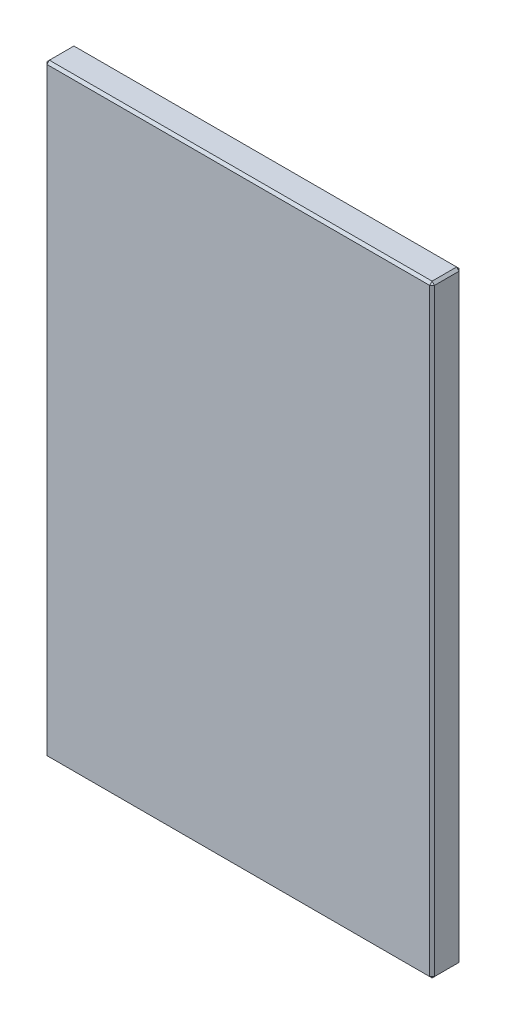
ISO-10303-21;
HEADER;
FILE_DESCRIPTION(('STEP AP214'),'2;1');
FILE_NAME('part.step','',(''),(''),'','','');
FILE_SCHEMA(('AUTOMOTIVE_DESIGN { 1 0 10303 214 1 1 1 1 }'));
ENDSEC;
DATA;
#1=APPLICATION_CONTEXT('core data for automotive mechanical design processes');
#2=APPLICATION_PROTOCOL_DEFINITION('international standard','automotive_design',2000,#1);
#3=PRODUCT_CONTEXT('',#1,'mechanical');
#4=PRODUCT('Part','Part','',(#3));
#5=PRODUCT_RELATED_PRODUCT_CATEGORY('part','',(#4));
#6=PRODUCT_DEFINITION_FORMATION('','',#4);
#7=PRODUCT_DEFINITION_CONTEXT('part definition',#1,'design');
#8=PRODUCT_DEFINITION('design','',#6,#7);
#9=PRODUCT_DEFINITION_SHAPE('','',#8);
#10=(LENGTH_UNIT() NAMED_UNIT(*) SI_UNIT(.MILLI.,.METRE.));
#11=(NAMED_UNIT(*) PLANE_ANGLE_UNIT() SI_UNIT($,.RADIAN.));
#12=(NAMED_UNIT(*) SI_UNIT($,.STERADIAN.) SOLID_ANGLE_UNIT());
#13=UNCERTAINTY_MEASURE_WITH_UNIT(LENGTH_MEASURE(1.E-05),#10,'distance_accuracy_value','');
#14=(GEOMETRIC_REPRESENTATION_CONTEXT(3) GLOBAL_UNCERTAINTY_ASSIGNED_CONTEXT((#13)) GLOBAL_UNIT_ASSIGNED_CONTEXT((#10,
#11,#12)) REPRESENTATION_CONTEXT('',''));
#15=CARTESIAN_POINT('',(0.,0.,0.));
#16=DIRECTION('',(0.,0.,1.));
#17=DIRECTION('',(1.,0.,0.));
#18=AXIS2_PLACEMENT_3D('',#15,#16,#17);
#19=CARTESIAN_POINT('',(-79.,-123.,12.));
#20=DIRECTION('',(1.,0.,0.));
#21=DIRECTION('',(0.,0.,-1.));
#22=AXIS2_PLACEMENT_3D('',#19,#20,#21);
#23=PLANE('',#22);
#24=DIRECTION('',(0.,0.,-1.));
#25=VECTOR('',#24,1.);
#26=CARTESIAN_POINT('',(-79.,122.,12.));
#27=LINE('',#26,#25);
#28=CARTESIAN_POINT('',(-79.,122.,11.));
#29=VERTEX_POINT('',#28);
#30=CARTESIAN_POINT('',(-79.,122.,1.));
#31=VERTEX_POINT('',#30);
#32=EDGE_CURVE('E114',#29,#31,#27,.T.);
#33=ORIENTED_EDGE('',*,*,#32,.T.);
#34=DIRECTION('',(0.,-1.,0.));
#35=VECTOR('',#34,1.);
#36=CARTESIAN_POINT('',(-79.,-123.,1.));
#37=LINE('',#36,#35);
#38=CARTESIAN_POINT('',(-79.,-122.,1.));
#39=VERTEX_POINT('',#38);
#40=EDGE_CURVE('E110',#31,#39,#37,.T.);
#41=ORIENTED_EDGE('',*,*,#40,.T.);
#42=DIRECTION('',(0.,0.,1.));
#43=VECTOR('',#42,1.);
#44=CARTESIAN_POINT('',(-79.,-122.,12.));
#45=LINE('',#44,#43);
#46=CARTESIAN_POINT('',(-79.,-122.,11.));
#47=VERTEX_POINT('',#46);
#48=EDGE_CURVE('E103',#39,#47,#45,.T.);
#49=ORIENTED_EDGE('',*,*,#48,.T.);
#50=DIRECTION('',(0.,1.,0.));
#51=VECTOR('',#50,1.);
#52=CARTESIAN_POINT('',(-79.,123.,11.));
#53=LINE('',#52,#51);
#54=EDGE_CURVE('E107',#47,#29,#53,.T.);
#55=ORIENTED_EDGE('',*,*,#54,.T.);
#56=EDGE_LOOP('',(#33,#41,#49,#55));
#57=FACE_BOUND('',#56,.T.);
#58=ADVANCED_FACE('F15',(#57),#23,.F.);
#59=CARTESIAN_POINT('',(79.,-123.,12.));
#60=DIRECTION('',(0.,1.,0.));
#61=DIRECTION('',(0.,0.,1.));
#62=AXIS2_PLACEMENT_3D('',#59,#60,#61);
#63=PLANE('',#62);
#64=DIRECTION('',(0.,0.,-1.));
#65=VECTOR('',#64,1.);
#66=CARTESIAN_POINT('',(-78.,-123.,12.));
#67=LINE('',#66,#65);
#68=CARTESIAN_POINT('',(-78.,-123.,11.));
#69=VERTEX_POINT('',#68);
#70=CARTESIAN_POINT('',(-78.,-123.,1.));
#71=VERTEX_POINT('',#70);
#72=EDGE_CURVE('E122',#69,#71,#67,.T.);
#73=ORIENTED_EDGE('',*,*,#72,.T.);
#74=DIRECTION('',(1.,0.,0.));
#75=VECTOR('',#74,1.);
#76=CARTESIAN_POINT('',(79.,-123.,1.));
#77=LINE('',#76,#75);
#78=CARTESIAN_POINT('',(78.,-123.,1.));
#79=VERTEX_POINT('',#78);
#80=EDGE_CURVE('E160',#71,#79,#77,.T.);
#81=ORIENTED_EDGE('',*,*,#80,.T.);
#82=DIRECTION('',(0.,0.,1.));
#83=VECTOR('',#82,1.);
#84=CARTESIAN_POINT('',(78.,-123.,12.));
#85=LINE('',#84,#83);
#86=CARTESIAN_POINT('',(78.,-123.,11.));
#87=VERTEX_POINT('',#86);
#88=EDGE_CURVE('E157',#79,#87,#85,.T.);
#89=ORIENTED_EDGE('',*,*,#88,.T.);
#90=DIRECTION('',(-1.,0.,0.));
#91=VECTOR('',#90,1.);
#92=CARTESIAN_POINT('',(-79.,-123.,11.));
#93=LINE('',#92,#91);
#94=EDGE_CURVE('E155',#87,#69,#93,.T.);
#95=ORIENTED_EDGE('',*,*,#94,.T.);
#96=EDGE_LOOP('',(#73,#81,#89,#95));
#97=FACE_BOUND('',#96,.T.);
#98=ADVANCED_FACE('F277',(#97),#63,.F.);
#99=CARTESIAN_POINT('',(79.,-123.,12.));
#100=DIRECTION('',(-1.,0.,0.));
#101=DIRECTION('',(0.,0.,1.));
#102=AXIS2_PLACEMENT_3D('',#99,#100,#101);
#103=PLANE('',#102);
#104=DIRECTION('',(0.,-1.,0.));
#105=VECTOR('',#104,1.);
#106=CARTESIAN_POINT('',(79.,-123.,11.));
#107=LINE('',#106,#105);
#108=CARTESIAN_POINT('',(79.,122.,11.));
#109=VERTEX_POINT('',#108);
#110=CARTESIAN_POINT('',(79.,-122.,11.));
#111=VERTEX_POINT('',#110);
#112=EDGE_CURVE('E162',#109,#111,#107,.T.);
#113=ORIENTED_EDGE('',*,*,#112,.T.);
#114=DIRECTION('',(0.,0.,-1.));
#115=VECTOR('',#114,1.);
#116=CARTESIAN_POINT('',(79.,-122.,12.));
#117=LINE('',#116,#115);
#118=CARTESIAN_POINT('',(79.,-122.,1.));
#119=VERTEX_POINT('',#118);
#120=EDGE_CURVE('E168',#111,#119,#117,.T.);
#121=ORIENTED_EDGE('',*,*,#120,.T.);
#122=DIRECTION('',(0.,1.,0.));
#123=VECTOR('',#122,1.);
#124=CARTESIAN_POINT('',(79.,-123.,1.));
#125=LINE('',#124,#123);
#126=CARTESIAN_POINT('',(79.,122.,1.));
#127=VERTEX_POINT('',#126);
#128=EDGE_CURVE('E166',#119,#127,#125,.T.);
#129=ORIENTED_EDGE('',*,*,#128,.T.);
#130=DIRECTION('',(0.,0.,1.));
#131=VECTOR('',#130,1.);
#132=CARTESIAN_POINT('',(79.,122.,12.));
#133=LINE('',#132,#131);
#134=EDGE_CURVE('E164',#127,#109,#133,.T.);
#135=ORIENTED_EDGE('',*,*,#134,.T.);
#136=EDGE_LOOP('',(#113,#121,#129,#135));
#137=FACE_BOUND('',#136,.T.);
#138=ADVANCED_FACE('F254',(#137),#103,.F.);
#139=CARTESIAN_POINT('',(79.,123.,12.));
#140=DIRECTION('',(0.,-1.,0.));
#141=DIRECTION('',(1.,0.,0.));
#142=AXIS2_PLACEMENT_3D('',#139,#140,#141);
#143=PLANE('',#142);
#144=DIRECTION('',(-1.,0.,0.));
#145=VECTOR('',#144,1.);
#146=CARTESIAN_POINT('',(79.,123.,1.));
#147=LINE('',#146,#145);
#148=CARTESIAN_POINT('',(78.,123.,1.));
#149=VERTEX_POINT('',#148);
#150=CARTESIAN_POINT('',(-78.,123.,1.));
#151=VERTEX_POINT('',#150);
#152=EDGE_CURVE('E150',#149,#151,#147,.T.);
#153=ORIENTED_EDGE('',*,*,#152,.T.);
#154=DIRECTION('',(0.,0.,1.));
#155=VECTOR('',#154,1.);
#156=CARTESIAN_POINT('',(-78.,123.,12.));
#157=LINE('',#156,#155);
#158=CARTESIAN_POINT('',(-78.,123.,11.));
#159=VERTEX_POINT('',#158);
#160=EDGE_CURVE('E152',#151,#159,#157,.T.);
#161=ORIENTED_EDGE('',*,*,#160,.T.);
#162=DIRECTION('',(1.,0.,0.));
#163=VECTOR('',#162,1.);
#164=CARTESIAN_POINT('',(79.,123.,11.));
#165=LINE('',#164,#163);
#166=CARTESIAN_POINT('',(78.,123.,11.));
#167=VERTEX_POINT('',#166);
#168=EDGE_CURVE('E146',#159,#167,#165,.T.);
#169=ORIENTED_EDGE('',*,*,#168,.T.);
#170=DIRECTION('',(0.,0.,-1.));
#171=VECTOR('',#170,1.);
#172=CARTESIAN_POINT('',(78.,123.,12.));
#173=LINE('',#172,#171);
#174=EDGE_CURVE('E148',#167,#149,#173,.T.);
#175=ORIENTED_EDGE('',*,*,#174,.T.);
#176=EDGE_LOOP('',(#153,#161,#169,#175));
#177=FACE_BOUND('',#176,.T.);
#178=ADVANCED_FACE('F286',(#177),#143,.F.);
#179=CARTESIAN_POINT('',(0.,0.,12.));
#180=DIRECTION('',(0.,0.,1.));
#181=DIRECTION('',(1.,0.,0.));
#182=AXIS2_PLACEMENT_3D('',#179,#180,#181);
#183=PLANE('',#182);
#184=DIRECTION('',(0.,1.,0.));
#185=VECTOR('',#184,1.);
#186=CARTESIAN_POINT('',(78.,123.,12.));
#187=LINE('',#186,#185);
#188=CARTESIAN_POINT('',(78.,-122.,12.));
#189=VERTEX_POINT('',#188);
#190=CARTESIAN_POINT('',(78.,122.,12.));
#191=VERTEX_POINT('',#190);
#192=EDGE_CURVE('E24',#189,#191,#187,.T.);
#193=ORIENTED_EDGE('',*,*,#192,.T.);
#194=DIRECTION('',(-1.,0.,0.));
#195=VECTOR('',#194,1.);
#196=CARTESIAN_POINT('',(-79.,122.,12.));
#197=LINE('',#196,#195);
#198=CARTESIAN_POINT('',(-78.,122.,12.));
#199=VERTEX_POINT('',#198);
#200=EDGE_CURVE('E9',#191,#199,#197,.T.);
#201=ORIENTED_EDGE('',*,*,#200,.T.);
#202=DIRECTION('',(0.,-1.,0.));
#203=VECTOR('',#202,1.);
#204=CARTESIAN_POINT('',(-78.,-123.,12.));
#205=LINE('',#204,#203);
#206=CARTESIAN_POINT('',(-78.,-122.,12.));
#207=VERTEX_POINT('',#206);
#208=EDGE_CURVE('E180',#199,#207,#205,.T.);
#209=ORIENTED_EDGE('',*,*,#208,.T.);
#210=DIRECTION('',(1.,0.,0.));
#211=VECTOR('',#210,1.);
#212=CARTESIAN_POINT('',(79.,-122.,12.));
#213=LINE('',#212,#211);
#214=EDGE_CURVE('E35',#207,#189,#213,.T.);
#215=ORIENTED_EDGE('',*,*,#214,.T.);
#216=EDGE_LOOP('',(#193,#201,#209,#215));
#217=FACE_BOUND('',#216,.T.);
#218=ADVANCED_FACE('F351',(#217),#183,.T.);
#219=CARTESIAN_POINT('',(0.,0.,0.));
#220=DIRECTION('',(0.,0.,1.));
#221=DIRECTION('',(1.,0.,0.));
#222=AXIS2_PLACEMENT_3D('',#219,#220,#221);
#223=PLANE('',#222);
#224=DIRECTION('',(0.,-1.,0.));
#225=VECTOR('',#224,1.);
#226=CARTESIAN_POINT('',(78.,0.,0.));
#227=LINE('',#226,#225);
#228=CARTESIAN_POINT('',(78.,122.,0.));
#229=VERTEX_POINT('',#228);
#230=CARTESIAN_POINT('',(78.,-122.,0.));
#231=VERTEX_POINT('',#230);
#232=EDGE_CURVE('E175',#229,#231,#227,.T.);
#233=ORIENTED_EDGE('',*,*,#232,.T.);
#234=DIRECTION('',(-1.,0.,0.));
#235=VECTOR('',#234,1.);
#236=CARTESIAN_POINT('',(0.,-122.,0.));
#237=LINE('',#236,#235);
#238=CARTESIAN_POINT('',(-78.,-122.,0.));
#239=VERTEX_POINT('',#238);
#240=EDGE_CURVE('E177',#231,#239,#237,.T.);
#241=ORIENTED_EDGE('',*,*,#240,.T.);
#242=DIRECTION('',(0.,1.,0.));
#243=VECTOR('',#242,1.);
#244=CARTESIAN_POINT('',(-78.,0.,0.));
#245=LINE('',#244,#243);
#246=CARTESIAN_POINT('',(-78.,122.,0.));
#247=VERTEX_POINT('',#246);
#248=EDGE_CURVE('E173',#239,#247,#245,.T.);
#249=ORIENTED_EDGE('',*,*,#248,.T.);
#250=DIRECTION('',(1.,0.,0.));
#251=VECTOR('',#250,1.);
#252=CARTESIAN_POINT('',(0.,122.,0.));
#253=LINE('',#252,#251);
#254=EDGE_CURVE('E171',#247,#229,#253,.T.);
#255=ORIENTED_EDGE('',*,*,#254,.T.);
#256=EDGE_LOOP('',(#233,#241,#249,#255));
#257=FACE_BOUND('',#256,.T.);
#258=ADVANCED_FACE('F246',(#257),#223,.F.);
#259=CARTESIAN_POINT('',(79.,-122.,12.));
#260=DIRECTION('',(-0.707106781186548,0.707106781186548,0.));
#261=DIRECTION('',(0.,0.,-1.));
#262=AXIS2_PLACEMENT_3D('',#259,#260,#261);
#263=PLANE('',#262);
#264=DIRECTION('',(-0.707106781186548,-0.707106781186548,0.));
#265=VECTOR('',#264,1.);
#266=CARTESIAN_POINT('',(78.,-123.,11.));
#267=LINE('',#266,#265);
#268=EDGE_CURVE('E19',#87,#111,#267,.F.);
#269=ORIENTED_EDGE('',*,*,#268,.F.);
#270=ORIENTED_EDGE('',*,*,#88,.F.);
#271=DIRECTION('',(0.707106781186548,0.707106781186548,0.));
#272=VECTOR('',#271,1.);
#273=CARTESIAN_POINT('',(79.,-122.,1.));
#274=LINE('',#273,#272);
#275=EDGE_CURVE('E142',#119,#79,#274,.F.);
#276=ORIENTED_EDGE('',*,*,#275,.F.);
#277=ORIENTED_EDGE('',*,*,#120,.F.);
#278=EDGE_LOOP('',(#269,#270,#276,#277));
#279=FACE_BOUND('',#278,.T.);
#280=ADVANCED_FACE('F17',(#279),#263,.F.);
#281=CARTESIAN_POINT('',(78.,-123.,11.));
#282=DIRECTION('',(0.577350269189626,-0.577350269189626,0.577350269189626));
#283=DIRECTION('',(0.707106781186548,0.,-0.707106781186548));
#284=AXIS2_PLACEMENT_3D('',#281,#282,#283);
#285=PLANE('',#284);
#286=DIRECTION('',(0.,-0.707106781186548,-0.707106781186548));
#287=VECTOR('',#286,1.);
#288=CARTESIAN_POINT('',(78.,-123.,11.));
#289=LINE('',#288,#287);
#290=EDGE_CURVE('E227',#87,#189,#289,.F.);
#291=ORIENTED_EDGE('',*,*,#290,.F.);
#292=ORIENTED_EDGE('',*,*,#268,.T.);
#293=DIRECTION('',(-0.707106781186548,0.,0.707106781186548));
#294=VECTOR('',#293,1.);
#295=CARTESIAN_POINT('',(78.5,-122.,11.5));
#296=LINE('',#295,#294);
#297=EDGE_CURVE('E229',#189,#111,#296,.F.);
#298=ORIENTED_EDGE('',*,*,#297,.F.);
#299=EDGE_LOOP('',(#291,#292,#298));
#300=FACE_BOUND('',#299,.T.);
#301=ADVANCED_FACE('F272',(#300),#285,.T.);
#302=CARTESIAN_POINT('',(79.,-122.,1.));
#303=DIRECTION('',(0.577350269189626,-0.577350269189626,-0.577350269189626));
#304=DIRECTION('',(-0.707106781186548,0.,-0.707106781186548));
#305=AXIS2_PLACEMENT_3D('',#302,#303,#304);
#306=PLANE('',#305);
#307=DIRECTION('',(-0.707106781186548,0.,-0.707106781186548));
#308=VECTOR('',#307,1.);
#309=CARTESIAN_POINT('',(79.,-122.,1.));
#310=LINE('',#309,#308);
#311=EDGE_CURVE('E221',#119,#231,#310,.T.);
#312=ORIENTED_EDGE('',*,*,#311,.F.);
#313=ORIENTED_EDGE('',*,*,#275,.T.);
#314=DIRECTION('',(0.,-0.707106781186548,0.707106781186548));
#315=VECTOR('',#314,1.);
#316=CARTESIAN_POINT('',(78.,-122.5,0.5));
#317=LINE('',#316,#315);
#318=EDGE_CURVE('E224',#231,#79,#317,.T.);
#319=ORIENTED_EDGE('',*,*,#318,.F.);
#320=EDGE_LOOP('',(#312,#313,#319));
#321=FACE_BOUND('',#320,.T.);
#322=ADVANCED_FACE('F236',(#321),#306,.T.);
#323=CARTESIAN_POINT('',(78.,0.,12.));
#324=DIRECTION('',(0.707106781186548,0.,0.707106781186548));
#325=DIRECTION('',(0.,-1.,0.));
#326=AXIS2_PLACEMENT_3D('',#323,#324,#325);
#327=PLANE('',#326);
#328=ORIENTED_EDGE('',*,*,#297,.T.);
#329=ORIENTED_EDGE('',*,*,#112,.F.);
#330=DIRECTION('',(0.707106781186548,0.,-0.707106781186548));
#331=VECTOR('',#330,1.);
#332=CARTESIAN_POINT('',(79.,122.,11.));
#333=LINE('',#332,#331);
#334=EDGE_CURVE('E215',#191,#109,#333,.T.);
#335=ORIENTED_EDGE('',*,*,#334,.F.);
#336=ORIENTED_EDGE('',*,*,#192,.F.);
#337=EDGE_LOOP('',(#328,#329,#335,#336));
#338=FACE_BOUND('',#337,.T.);
#339=ADVANCED_FACE('F267',(#338),#327,.T.);
#340=CARTESIAN_POINT('',(0.,-122.,12.));
#341=DIRECTION('',(0.,-0.707106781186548,0.707106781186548));
#342=DIRECTION('',(-1.,0.,0.));
#343=AXIS2_PLACEMENT_3D('',#340,#341,#342);
#344=PLANE('',#343);
#345=ORIENTED_EDGE('',*,*,#290,.T.);
#346=ORIENTED_EDGE('',*,*,#214,.F.);
#347=DIRECTION('',(0.,0.707106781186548,0.707106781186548));
#348=VECTOR('',#347,1.);
#349=CARTESIAN_POINT('',(-78.,-122.5,11.5));
#350=LINE('',#349,#348);
#351=EDGE_CURVE('E126',#69,#207,#350,.T.);
#352=ORIENTED_EDGE('',*,*,#351,.F.);
#353=ORIENTED_EDGE('',*,*,#94,.F.);
#354=EDGE_LOOP('',(#345,#346,#352,#353));
#355=FACE_BOUND('',#354,.T.);
#356=ADVANCED_FACE('F275',(#355),#344,.T.);
#357=CARTESIAN_POINT('',(-78.,-123.,12.));
#358=DIRECTION('',(0.707106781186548,0.707106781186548,0.));
#359=DIRECTION('',(0.,0.,-1.));
#360=AXIS2_PLACEMENT_3D('',#357,#358,#359);
#361=PLANE('',#360);
#362=DIRECTION('',(0.707106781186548,-0.707106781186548,0.));
#363=VECTOR('',#362,1.);
#364=CARTESIAN_POINT('',(-78.,-123.,1.));
#365=LINE('',#364,#363);
#366=EDGE_CURVE('E127',#71,#39,#365,.F.);
#367=ORIENTED_EDGE('',*,*,#366,.F.);
#368=ORIENTED_EDGE('',*,*,#72,.F.);
#369=DIRECTION('',(-0.707106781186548,0.707106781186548,0.));
#370=VECTOR('',#369,1.);
#371=CARTESIAN_POINT('',(-79.,-122.,11.));
#372=LINE('',#371,#370);
#373=EDGE_CURVE('E118',#47,#69,#372,.F.);
#374=ORIENTED_EDGE('',*,*,#373,.F.);
#375=ORIENTED_EDGE('',*,*,#48,.F.);
#376=EDGE_LOOP('',(#367,#368,#374,#375));
#377=FACE_BOUND('',#376,.T.);
#378=ADVANCED_FACE('F120',(#377),#361,.F.);
#379=CARTESIAN_POINT('',(79.,-123.,1.));
#380=DIRECTION('',(0.,0.707106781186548,0.707106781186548));
#381=DIRECTION('',(1.,0.,0.));
#382=AXIS2_PLACEMENT_3D('',#379,#380,#381);
#383=PLANE('',#382);
#384=ORIENTED_EDGE('',*,*,#318,.T.);
#385=ORIENTED_EDGE('',*,*,#80,.F.);
#386=DIRECTION('',(0.,0.707106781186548,-0.707106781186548));
#387=VECTOR('',#386,1.);
#388=CARTESIAN_POINT('',(-78.,-123.,1.));
#389=LINE('',#388,#387);
#390=EDGE_CURVE('E211',#239,#71,#389,.F.);
#391=ORIENTED_EDGE('',*,*,#390,.F.);
#392=ORIENTED_EDGE('',*,*,#240,.F.);
#393=EDGE_LOOP('',(#384,#385,#391,#392));
#394=FACE_BOUND('',#393,.T.);
#395=ADVANCED_FACE('F243',(#394),#383,.F.);
#396=CARTESIAN_POINT('',(79.,-123.,1.));
#397=DIRECTION('',(-0.707106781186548,0.,0.707106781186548));
#398=DIRECTION('',(0.,1.,0.));
#399=AXIS2_PLACEMENT_3D('',#396,#397,#398);
#400=PLANE('',#399);
#401=ORIENTED_EDGE('',*,*,#311,.T.);
#402=ORIENTED_EDGE('',*,*,#232,.F.);
#403=DIRECTION('',(0.707106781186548,0.,0.707106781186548));
#404=VECTOR('',#403,1.);
#405=CARTESIAN_POINT('',(79.,122.,1.));
#406=LINE('',#405,#404);
#407=EDGE_CURVE('E208',#127,#229,#406,.F.);
#408=ORIENTED_EDGE('',*,*,#407,.F.);
#409=ORIENTED_EDGE('',*,*,#128,.F.);
#410=EDGE_LOOP('',(#401,#402,#408,#409));
#411=FACE_BOUND('',#410,.T.);
#412=ADVANCED_FACE('F251',(#411),#400,.F.);
#413=CARTESIAN_POINT('',(78.,123.,12.));
#414=DIRECTION('',(-0.707106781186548,-0.707106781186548,0.));
#415=DIRECTION('',(0.,0.,-1.));
#416=AXIS2_PLACEMENT_3D('',#413,#414,#415);
#417=PLANE('',#416);
#418=DIRECTION('',(0.707106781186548,-0.707106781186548,0.));
#419=VECTOR('',#418,1.);
#420=CARTESIAN_POINT('',(79.,122.,11.));
#421=LINE('',#420,#419);
#422=EDGE_CURVE('E218',#109,#167,#421,.F.);
#423=ORIENTED_EDGE('',*,*,#422,.F.);
#424=ORIENTED_EDGE('',*,*,#134,.F.);
#425=DIRECTION('',(-0.707106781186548,0.707106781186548,0.));
#426=VECTOR('',#425,1.);
#427=CARTESIAN_POINT('',(79.,122.,1.));
#428=LINE('',#427,#426);
#429=EDGE_CURVE('E205',#149,#127,#428,.F.);
#430=ORIENTED_EDGE('',*,*,#429,.F.);
#431=ORIENTED_EDGE('',*,*,#174,.F.);
#432=EDGE_LOOP('',(#423,#424,#430,#431));
#433=FACE_BOUND('',#432,.T.);
#434=ADVANCED_FACE('F259',(#433),#417,.F.);
#435=CARTESIAN_POINT('',(79.,122.,11.));
#436=DIRECTION('',(0.577350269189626,0.577350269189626,0.577350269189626));
#437=DIRECTION('',(0.707106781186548,0.,-0.707106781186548));
#438=AXIS2_PLACEMENT_3D('',#435,#436,#437);
#439=PLANE('',#438);
#440=ORIENTED_EDGE('',*,*,#334,.T.);
#441=ORIENTED_EDGE('',*,*,#422,.T.);
#442=DIRECTION('',(0.,-0.707106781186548,0.707106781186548));
#443=VECTOR('',#442,1.);
#444=CARTESIAN_POINT('',(78.,122.5,11.5));
#445=LINE('',#444,#443);
#446=EDGE_CURVE('E134',#191,#167,#445,.F.);
#447=ORIENTED_EDGE('',*,*,#446,.F.);
#448=EDGE_LOOP('',(#440,#441,#447));
#449=FACE_BOUND('',#448,.T.);
#450=ADVANCED_FACE('F264',(#449),#439,.T.);
#451=CARTESIAN_POINT('',(-79.,-122.,11.));
#452=DIRECTION('',(-0.577350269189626,-0.577350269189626,0.577350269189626));
#453=DIRECTION('',(0.707106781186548,0.,0.707106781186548));
#454=AXIS2_PLACEMENT_3D('',#451,#452,#453);
#455=PLANE('',#454);
#456=ORIENTED_EDGE('',*,*,#373,.T.);
#457=ORIENTED_EDGE('',*,*,#351,.T.);
#458=DIRECTION('',(-0.707106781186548,0.,-0.707106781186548));
#459=VECTOR('',#458,1.);
#460=CARTESIAN_POINT('',(-79.,-122.,11.));
#461=LINE('',#460,#459);
#462=EDGE_CURVE('E130',#47,#207,#461,.F.);
#463=ORIENTED_EDGE('',*,*,#462,.F.);
#464=EDGE_LOOP('',(#456,#457,#463));
#465=FACE_BOUND('',#464,.T.);
#466=ADVANCED_FACE('F131',(#465),#455,.T.);
#467=CARTESIAN_POINT('',(-78.,-123.,1.));
#468=DIRECTION('',(-0.577350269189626,-0.577350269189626,-0.577350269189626));
#469=DIRECTION('',(-0.707106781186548,0.,0.707106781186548));
#470=AXIS2_PLACEMENT_3D('',#467,#468,#469);
#471=PLANE('',#470);
#472=ORIENTED_EDGE('',*,*,#390,.T.);
#473=ORIENTED_EDGE('',*,*,#366,.T.);
#474=DIRECTION('',(-0.707106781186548,0.,0.707106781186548));
#475=VECTOR('',#474,1.);
#476=CARTESIAN_POINT('',(-78.5,-122.,0.5));
#477=LINE('',#476,#475);
#478=EDGE_CURVE('E135',#239,#39,#477,.T.);
#479=ORIENTED_EDGE('',*,*,#478,.F.);
#480=EDGE_LOOP('',(#472,#473,#479));
#481=FACE_BOUND('',#480,.T.);
#482=ADVANCED_FACE('F320',(#481),#471,.T.);
#483=CARTESIAN_POINT('',(79.,122.,1.));
#484=DIRECTION('',(0.577350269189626,0.577350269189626,-0.577350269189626));
#485=DIRECTION('',(-0.707106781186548,0.,-0.707106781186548));
#486=AXIS2_PLACEMENT_3D('',#483,#484,#485);
#487=PLANE('',#486);
#488=ORIENTED_EDGE('',*,*,#429,.T.);
#489=ORIENTED_EDGE('',*,*,#407,.T.);
#490=DIRECTION('',(0.,-0.707106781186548,-0.707106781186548));
#491=VECTOR('',#490,1.);
#492=CARTESIAN_POINT('',(78.,122.5,0.5));
#493=LINE('',#492,#491);
#494=EDGE_CURVE('E198',#149,#229,#493,.T.);
#495=ORIENTED_EDGE('',*,*,#494,.F.);
#496=EDGE_LOOP('',(#488,#489,#495));
#497=FACE_BOUND('',#496,.T.);
#498=ADVANCED_FACE('F316',(#497),#487,.T.);
#499=CARTESIAN_POINT('',(0.,122.,12.));
#500=DIRECTION('',(0.,0.707106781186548,0.707106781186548));
#501=DIRECTION('',(1.,0.,0.));
#502=AXIS2_PLACEMENT_3D('',#499,#500,#501);
#503=PLANE('',#502);
#504=ORIENTED_EDGE('',*,*,#446,.T.);
#505=ORIENTED_EDGE('',*,*,#168,.F.);
#506=DIRECTION('',(0.,0.707106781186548,-0.707106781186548));
#507=VECTOR('',#506,1.);
#508=CARTESIAN_POINT('',(-78.,123.,11.));
#509=LINE('',#508,#507);
#510=EDGE_CURVE('E195',#199,#159,#509,.T.);
#511=ORIENTED_EDGE('',*,*,#510,.F.);
#512=ORIENTED_EDGE('',*,*,#200,.F.);
#513=EDGE_LOOP('',(#504,#505,#511,#512));
#514=FACE_BOUND('',#513,.T.);
#515=ADVANCED_FACE('F313',(#514),#503,.T.);
#516=CARTESIAN_POINT('',(-78.,0.,12.));
#517=DIRECTION('',(-0.707106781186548,0.,0.707106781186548));
#518=DIRECTION('',(0.,1.,0.));
#519=AXIS2_PLACEMENT_3D('',#516,#517,#518);
#520=PLANE('',#519);
#521=ORIENTED_EDGE('',*,*,#462,.T.);
#522=ORIENTED_EDGE('',*,*,#208,.F.);
#523=DIRECTION('',(0.707106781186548,0.,0.707106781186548));
#524=VECTOR('',#523,1.);
#525=CARTESIAN_POINT('',(-78.5,122.,11.5));
#526=LINE('',#525,#524);
#527=EDGE_CURVE('E138',#29,#199,#526,.T.);
#528=ORIENTED_EDGE('',*,*,#527,.F.);
#529=ORIENTED_EDGE('',*,*,#54,.F.);
#530=EDGE_LOOP('',(#521,#522,#528,#529));
#531=FACE_BOUND('',#530,.T.);
#532=ADVANCED_FACE('F137',(#531),#520,.T.);
#533=CARTESIAN_POINT('',(-79.,-123.,1.));
#534=DIRECTION('',(0.707106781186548,0.,0.707106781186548));
#535=DIRECTION('',(0.,-1.,0.));
#536=AXIS2_PLACEMENT_3D('',#533,#534,#535);
#537=PLANE('',#536);
#538=ORIENTED_EDGE('',*,*,#478,.T.);
#539=ORIENTED_EDGE('',*,*,#40,.F.);
#540=DIRECTION('',(0.707106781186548,0.,-0.707106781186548));
#541=VECTOR('',#540,1.);
#542=CARTESIAN_POINT('',(-79.,122.,1.));
#543=LINE('',#542,#541);
#544=EDGE_CURVE('E191',#247,#31,#543,.F.);
#545=ORIENTED_EDGE('',*,*,#544,.F.);
#546=ORIENTED_EDGE('',*,*,#248,.F.);
#547=EDGE_LOOP('',(#538,#539,#545,#546));
#548=FACE_BOUND('',#547,.T.);
#549=ADVANCED_FACE('F306',(#548),#537,.F.);
#550=CARTESIAN_POINT('',(79.,123.,1.));
#551=DIRECTION('',(0.,-0.707106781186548,0.707106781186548));
#552=DIRECTION('',(-1.,0.,0.));
#553=AXIS2_PLACEMENT_3D('',#550,#551,#552);
#554=PLANE('',#553);
#555=ORIENTED_EDGE('',*,*,#494,.T.);
#556=ORIENTED_EDGE('',*,*,#254,.F.);
#557=DIRECTION('',(0.,0.707106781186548,0.707106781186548));
#558=VECTOR('',#557,1.);
#559=CARTESIAN_POINT('',(-78.,122.5,0.5));
#560=LINE('',#559,#558);
#561=EDGE_CURVE('E188',#151,#247,#560,.F.);
#562=ORIENTED_EDGE('',*,*,#561,.F.);
#563=ORIENTED_EDGE('',*,*,#152,.F.);
#564=EDGE_LOOP('',(#555,#556,#562,#563));
#565=FACE_BOUND('',#564,.T.);
#566=ADVANCED_FACE('F302',(#565),#554,.F.);
#567=CARTESIAN_POINT('',(-78.,123.,11.));
#568=DIRECTION('',(-0.577350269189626,0.577350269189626,0.577350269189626));
#569=DIRECTION('',(0.707106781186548,0.,0.707106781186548));
#570=AXIS2_PLACEMENT_3D('',#567,#568,#569);
#571=PLANE('',#570);
#572=ORIENTED_EDGE('',*,*,#527,.T.);
#573=ORIENTED_EDGE('',*,*,#510,.T.);
#574=DIRECTION('',(0.707106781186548,0.707106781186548,0.));
#575=VECTOR('',#574,1.);
#576=CARTESIAN_POINT('',(-78.,123.,11.));
#577=LINE('',#576,#575);
#578=EDGE_CURVE('E186',#29,#159,#577,.T.);
#579=ORIENTED_EDGE('',*,*,#578,.F.);
#580=EDGE_LOOP('',(#572,#573,#579));
#581=FACE_BOUND('',#580,.T.);
#582=ADVANCED_FACE('F298',(#581),#571,.T.);
#583=CARTESIAN_POINT('',(-79.,122.,1.));
#584=DIRECTION('',(-0.577350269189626,0.577350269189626,-0.577350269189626));
#585=DIRECTION('',(-0.707106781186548,0.,0.707106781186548));
#586=AXIS2_PLACEMENT_3D('',#583,#584,#585);
#587=PLANE('',#586);
#588=ORIENTED_EDGE('',*,*,#561,.T.);
#589=ORIENTED_EDGE('',*,*,#544,.T.);
#590=DIRECTION('',(-0.707106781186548,-0.707106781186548,0.));
#591=VECTOR('',#590,1.);
#592=CARTESIAN_POINT('',(-79.,122.,1.));
#593=LINE('',#592,#591);
#594=EDGE_CURVE('E184',#151,#31,#593,.T.);
#595=ORIENTED_EDGE('',*,*,#594,.F.);
#596=EDGE_LOOP('',(#588,#589,#595));
#597=FACE_BOUND('',#596,.T.);
#598=ADVANCED_FACE('F294',(#597),#587,.T.);
#599=CARTESIAN_POINT('',(-79.,122.,12.));
#600=DIRECTION('',(0.707106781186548,-0.707106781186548,0.));
#601=DIRECTION('',(0.,0.,-1.));
#602=AXIS2_PLACEMENT_3D('',#599,#600,#601);
#603=PLANE('',#602);
#604=ORIENTED_EDGE('',*,*,#578,.T.);
#605=ORIENTED_EDGE('',*,*,#160,.F.);
#606=ORIENTED_EDGE('',*,*,#594,.T.);
#607=ORIENTED_EDGE('',*,*,#32,.F.);
#608=EDGE_LOOP('',(#604,#605,#606,#607));
#609=FACE_BOUND('',#608,.T.);
#610=ADVANCED_FACE('F291',(#609),#603,.F.);
#611=CLOSED_SHELL('',(#58,#98,#138,#178,#218,#258,#280,#301,#322,#339,#356,#378,#395,#412,#434,
#450,#466,#482,#498,#515,#532,#549,#566,#582,#598,#610));
#612=MANIFOLD_SOLID_BREP('B1',#611);
#613=ADVANCED_BREP_SHAPE_REPRESENTATION('',(#18,#612),#14);
#614=SHAPE_DEFINITION_REPRESENTATION(#9,#613);
ENDSEC;
END-ISO-10303-21;
